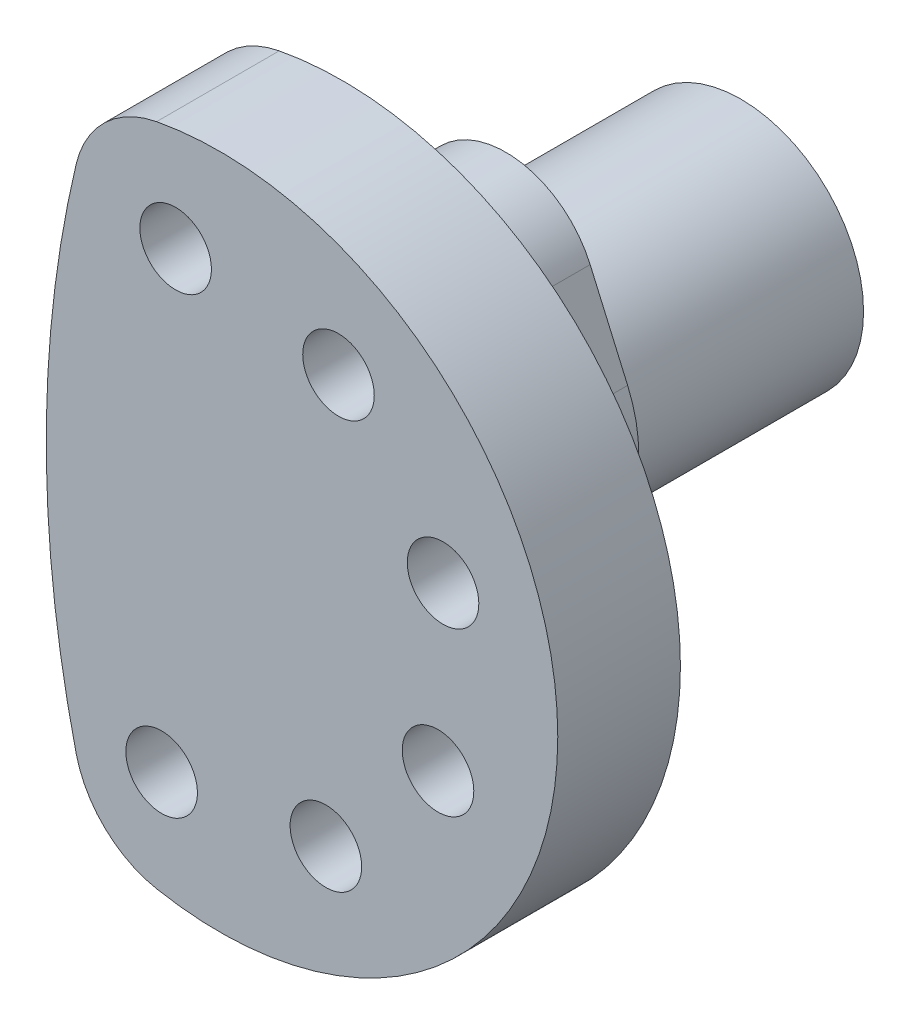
from build123d import *

# Parameters (mm, degrees)
BOSS_EXTRUDE1_DEPTH = 12
CUT_EXTRUDE1_REACH  = 50.299
SKETCH5_R           = 3.5
CIRPATTERN1_COUNT   = 6
CIRPATTERN1_ANGLE   = 205
BOSS_EXTRUDE2_DEPTH = 16
SKETCH4_R           = 12
BOSS_EXTRUDE3_DEPTH = 23


with BuildPart() as part:
    # Sketch2 → Boss-Extrude1 (new body)
    with BuildSketch(Plane.XY):
        with BuildLine():
            ThreePointArc((-6.174797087, -32.5), (33.081386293, 0), (-6.174797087, 32.5))
            ThreePointArc((-6.174797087, 32.5), (-11.215748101, 29.90668246), (-14.036872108, 24.989595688))
            ThreePointArc((-14.036872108, 24.989595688), (-16.967751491, 0), (-14.036872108, -24.989595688))
            ThreePointArc((-14.036872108, -24.989595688), (-11.215748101, -29.90668246), (-6.174797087, -32.5))
        make_face()
    extrude(amount=BOSS_EXTRUDE1_DEPTH)

    # Sketch5 → Cut-Extrude1 (cut, up to next)
    with BuildSketch(Plane(origin=(0, 0, 0), x_dir=(-1, 0, 0), z_dir=(0, 0, -1)), mode=Mode.PRIVATE) as cut_extrude1_sk1:
        with Locations((4.308249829, 22.675744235)):
            Circle(SKETCH5_R)
    cut_extrude1_tool1 = extrude(cut_extrude1_sk1.sketch, amount=-CUT_EXTRUDE1_REACH, mode=Mode.PRIVATE) & part.part
    cut_extrude1 = cut_extrude1_tool1.solids().sort_by_distance((-4.30825, 22.675744, 0))[0]
    add(cut_extrude1, mode=Mode.SUBTRACT)

    # CirPattern1: Cut-Extrude1 ×6 about axis
    cirpattern1_axis = Axis((0, 0, 0), (0, 0, -1))
    for i in range(1, CIRPATTERN1_COUNT):
        add(cut_extrude1.rotate(cirpattern1_axis, i * CIRPATTERN1_ANGLE / (CIRPATTERN1_COUNT - 1)), mode=Mode.SUBTRACT)

    # Sketch3 → Boss-Extrude2 (add)
    with BuildSketch(Plane.XY):
        with BuildLine():
            Line((-11.914696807, 5.2), (-8.248636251, 13.6))
            ThreePointArc((-8.248636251, 13.6), (0, 19), (8.248636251, 13.6))
            Line((8.248636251, 13.6), (11.914696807, 5.2))
            ThreePointArc((11.914696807, 5.2), (0, -13), (-11.914696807, 5.2))
        make_face()
    extrude(amount=-BOSS_EXTRUDE2_DEPTH)

    # Sketch4 → Boss-Extrude3 (add)
    with BuildSketch(Plane(origin=(0, 0, -16), x_dir=(-1, 0, 0), z_dir=(0, 0, -1))):
        Circle(SKETCH4_R)
    extrude(amount=BOSS_EXTRUDE3_DEPTH)


solid = part.part
